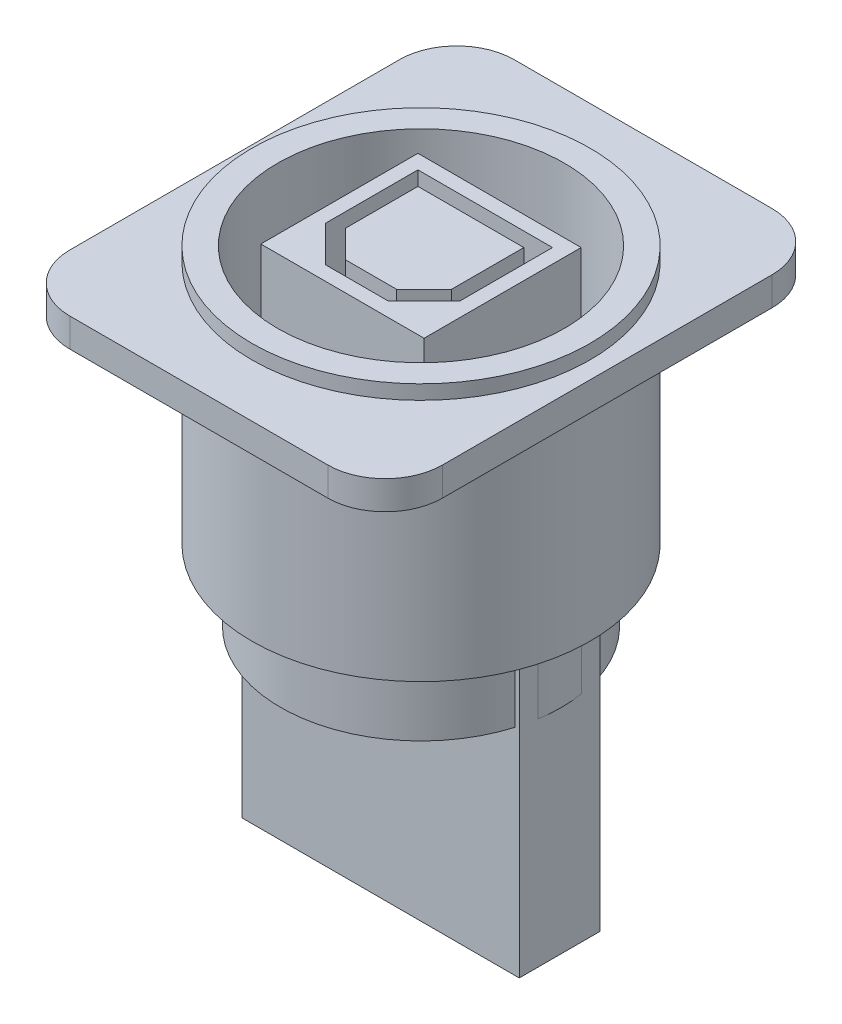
ISO-10303-21;
HEADER;
FILE_DESCRIPTION(('STEP AP214'),'2;1');
FILE_NAME('part.step','',(''),(''),'','','');
FILE_SCHEMA(('AUTOMOTIVE_DESIGN { 1 0 10303 214 1 1 1 1 }'));
ENDSEC;
DATA;
#1=APPLICATION_CONTEXT('core data for automotive mechanical design processes');
#2=APPLICATION_PROTOCOL_DEFINITION('international standard','automotive_design',2000,#1);
#3=PRODUCT_CONTEXT('',#1,'mechanical');
#4=PRODUCT('Part','Part','',(#3));
#5=PRODUCT_RELATED_PRODUCT_CATEGORY('part','',(#4));
#6=PRODUCT_DEFINITION_FORMATION('','',#4);
#7=PRODUCT_DEFINITION_CONTEXT('part definition',#1,'design');
#8=PRODUCT_DEFINITION('design','',#6,#7);
#9=PRODUCT_DEFINITION_SHAPE('','',#8);
#10=(LENGTH_UNIT() NAMED_UNIT(*) SI_UNIT(.MILLI.,.METRE.));
#11=(NAMED_UNIT(*) PLANE_ANGLE_UNIT() SI_UNIT($,.RADIAN.));
#12=(NAMED_UNIT(*) SI_UNIT($,.STERADIAN.) SOLID_ANGLE_UNIT());
#13=UNCERTAINTY_MEASURE_WITH_UNIT(LENGTH_MEASURE(1.E-05),#10,'distance_accuracy_value','');
#14=(GEOMETRIC_REPRESENTATION_CONTEXT(3) GLOBAL_UNCERTAINTY_ASSIGNED_CONTEXT((#13)) GLOBAL_UNIT_ASSIGNED_CONTEXT((#10,
#11,#12)) REPRESENTATION_CONTEXT('',''));
#15=CARTESIAN_POINT('',(0.,0.,0.));
#16=DIRECTION('',(0.,0.,1.));
#17=DIRECTION('',(1.,0.,0.));
#18=AXIS2_PLACEMENT_3D('',#15,#16,#17);
#19=CARTESIAN_POINT('',(9.68144968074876,-20.,-2.82375615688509));
#20=DIRECTION('',(-1.,0.,0.));
#21=DIRECTION('',(0.,0.,1.));
#22=AXIS2_PLACEMENT_3D('',#19,#20,#21);
#23=PLANE('',#22);
#24=DIRECTION('',(0.,1.,0.));
#25=VECTOR('',#24,1.);
#26=CARTESIAN_POINT('',(9.68144968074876,-5.,1.51971447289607));
#27=LINE('',#26,#25);
#28=CARTESIAN_POINT('',(9.68144968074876,0.,1.51971447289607));
#29=VERTEX_POINT('',#28);
#30=CARTESIAN_POINT('',(9.68144968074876,-5.,1.51971447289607));
#31=VERTEX_POINT('',#30);
#32=EDGE_CURVE('E357',#29,#31,#27,.F.);
#33=ORIENTED_EDGE('',*,*,#32,.F.);
#34=DIRECTION('',(0.,0.,1.));
#35=VECTOR('',#34,1.);
#36=CARTESIAN_POINT('',(9.68144968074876,0.,-2.82375615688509));
#37=LINE('',#36,#35);
#38=CARTESIAN_POINT('',(9.68144968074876,0.,2.82375615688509));
#39=VERTEX_POINT('',#38);
#40=EDGE_CURVE('E359',#29,#39,#37,.T.);
#41=ORIENTED_EDGE('',*,*,#40,.T.);
#42=DIRECTION('',(0.,1.,0.));
#43=VECTOR('',#42,1.);
#44=CARTESIAN_POINT('',(9.68144968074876,-20.,2.82375615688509));
#45=LINE('',#44,#43);
#46=CARTESIAN_POINT('',(9.68144968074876,-20.,2.82375615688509));
#47=VERTEX_POINT('',#46);
#48=EDGE_CURVE('E393',#47,#39,#45,.T.);
#49=ORIENTED_EDGE('',*,*,#48,.F.);
#50=DIRECTION('',(0.,0.,1.));
#51=VECTOR('',#50,1.);
#52=CARTESIAN_POINT('',(9.68144968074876,-20.,-2.82375615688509));
#53=LINE('',#52,#51);
#54=CARTESIAN_POINT('',(9.68144968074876,-20.,-2.82375615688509));
#55=VERTEX_POINT('',#54);
#56=EDGE_CURVE('E360',#55,#47,#53,.T.);
#57=ORIENTED_EDGE('',*,*,#56,.F.);
#58=DIRECTION('',(0.,1.,0.));
#59=VECTOR('',#58,1.);
#60=CARTESIAN_POINT('',(9.68144968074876,-20.,-2.82375615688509));
#61=LINE('',#60,#59);
#62=CARTESIAN_POINT('',(9.68144968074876,0.,-2.82375615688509));
#63=VERTEX_POINT('',#62);
#64=EDGE_CURVE('E370',#55,#63,#61,.T.);
#65=ORIENTED_EDGE('',*,*,#64,.T.);
#66=CARTESIAN_POINT('',(9.68144968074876,0.,-1.51971447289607));
#67=VERTEX_POINT('',#66);
#68=EDGE_CURVE('E371',#63,#67,#37,.T.);
#69=ORIENTED_EDGE('',*,*,#68,.T.);
#70=DIRECTION('',(0.,1.,0.));
#71=VECTOR('',#70,1.);
#72=CARTESIAN_POINT('',(9.68144968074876,-5.,-1.51971447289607));
#73=LINE('',#72,#71);
#74=CARTESIAN_POINT('',(9.68144968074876,-5.,-1.51971447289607));
#75=VERTEX_POINT('',#74);
#76=EDGE_CURVE('E355',#75,#67,#73,.T.);
#77=ORIENTED_EDGE('',*,*,#76,.F.);
#78=DIRECTION('',(0.,0.,1.));
#79=VECTOR('',#78,1.);
#80=CARTESIAN_POINT('',(9.68144968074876,-5.,-2.82375615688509));
#81=LINE('',#80,#79);
#82=EDGE_CURVE('E342',#75,#31,#81,.T.);
#83=ORIENTED_EDGE('',*,*,#82,.T.);
#84=EDGE_LOOP('',(#33,#41,#49,#57,#65,#69,#77,#83));
#85=FACE_BOUND('',#84,.T.);
#86=ADVANCED_FACE('F34',(#85),#23,.F.);
#87=CARTESIAN_POINT('',(-9.68144968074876,-20.,2.82375615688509));
#88=DIRECTION('',(0.,0.,-1.));
#89=DIRECTION('',(-1.,0.,0.));
#90=AXIS2_PLACEMENT_3D('',#87,#88,#89);
#91=PLANE('',#90);
#92=DIRECTION('',(0.,1.,0.));
#93=VECTOR('',#92,1.);
#94=CARTESIAN_POINT('',(-9.38437004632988,-5.,2.82375615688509));
#95=LINE('',#94,#93);
#96=CARTESIAN_POINT('',(-9.38437004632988,0.,2.82375615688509));
#97=VERTEX_POINT('',#96);
#98=CARTESIAN_POINT('',(-9.38437004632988,-5.,2.82375615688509));
#99=VERTEX_POINT('',#98);
#100=EDGE_CURVE('E352',#97,#99,#95,.F.);
#101=ORIENTED_EDGE('',*,*,#100,.F.);
#102=DIRECTION('',(-1.,0.,0.));
#103=VECTOR('',#102,1.);
#104=CARTESIAN_POINT('',(-9.68144968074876,0.,2.82375615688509));
#105=LINE('',#104,#103);
#106=CARTESIAN_POINT('',(-9.68144968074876,0.,2.82375615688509));
#107=VERTEX_POINT('',#106);
#108=EDGE_CURVE('E374',#97,#107,#105,.T.);
#109=ORIENTED_EDGE('',*,*,#108,.T.);
#110=DIRECTION('',(0.,1.,0.));
#111=VECTOR('',#110,1.);
#112=CARTESIAN_POINT('',(-9.68144968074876,-20.,2.82375615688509));
#113=LINE('',#112,#111);
#114=CARTESIAN_POINT('',(-9.68144968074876,-20.,2.82375615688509));
#115=VERTEX_POINT('',#114);
#116=EDGE_CURVE('E390',#115,#107,#113,.T.);
#117=ORIENTED_EDGE('',*,*,#116,.F.);
#118=DIRECTION('',(-1.,0.,0.));
#119=VECTOR('',#118,1.);
#120=CARTESIAN_POINT('',(-9.68144968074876,-20.,2.82375615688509));
#121=LINE('',#120,#119);
#122=EDGE_CURVE('E363',#47,#115,#121,.T.);
#123=ORIENTED_EDGE('',*,*,#122,.F.);
#124=ORIENTED_EDGE('',*,*,#48,.T.);
#125=CARTESIAN_POINT('',(9.38437004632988,0.,2.82375615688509));
#126=VERTEX_POINT('',#125);
#127=EDGE_CURVE('E375',#39,#126,#105,.T.);
#128=ORIENTED_EDGE('',*,*,#127,.T.);
#129=DIRECTION('',(0.,1.,0.));
#130=VECTOR('',#129,1.);
#131=CARTESIAN_POINT('',(9.38437004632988,-5.,2.82375615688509));
#132=LINE('',#131,#130);
#133=CARTESIAN_POINT('',(9.38437004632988,-5.,2.82375615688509));
#134=VERTEX_POINT('',#133);
#135=EDGE_CURVE('E350',#134,#126,#132,.T.);
#136=ORIENTED_EDGE('',*,*,#135,.F.);
#137=DIRECTION('',(-1.,0.,0.));
#138=VECTOR('',#137,1.);
#139=CARTESIAN_POINT('',(-9.68144968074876,-5.,2.82375615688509));
#140=LINE('',#139,#138);
#141=EDGE_CURVE('E339',#134,#99,#140,.T.);
#142=ORIENTED_EDGE('',*,*,#141,.T.);
#143=EDGE_LOOP('',(#101,#109,#117,#123,#124,#128,#136,#142));
#144=FACE_BOUND('',#143,.T.);
#145=ADVANCED_FACE('F638',(#144),#91,.F.);
#146=CARTESIAN_POINT('',(-9.68144968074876,-20.,-2.82375615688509));
#147=DIRECTION('',(1.,0.,0.));
#148=DIRECTION('',(0.,0.,-1.));
#149=AXIS2_PLACEMENT_3D('',#146,#147,#148);
#150=PLANE('',#149);
#151=DIRECTION('',(0.,1.,0.));
#152=VECTOR('',#151,1.);
#153=CARTESIAN_POINT('',(-9.68144968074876,-5.,-1.51971447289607));
#154=LINE('',#153,#152);
#155=CARTESIAN_POINT('',(-9.68144968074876,0.,-1.51971447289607));
#156=VERTEX_POINT('',#155);
#157=CARTESIAN_POINT('',(-9.68144968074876,-5.,-1.51971447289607));
#158=VERTEX_POINT('',#157);
#159=EDGE_CURVE('E347',#156,#158,#154,.F.);
#160=ORIENTED_EDGE('',*,*,#159,.F.);
#161=DIRECTION('',(0.,0.,-1.));
#162=VECTOR('',#161,1.);
#163=CARTESIAN_POINT('',(-9.68144968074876,0.,-2.82375615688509));
#164=LINE('',#163,#162);
#165=CARTESIAN_POINT('',(-9.68144968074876,0.,-2.82375615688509));
#166=VERTEX_POINT('',#165);
#167=EDGE_CURVE('E378',#156,#166,#164,.T.);
#168=ORIENTED_EDGE('',*,*,#167,.T.);
#169=DIRECTION('',(0.,1.,0.));
#170=VECTOR('',#169,1.);
#171=CARTESIAN_POINT('',(-9.68144968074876,-20.,-2.82375615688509));
#172=LINE('',#171,#170);
#173=CARTESIAN_POINT('',(-9.68144968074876,-20.,-2.82375615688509));
#174=VERTEX_POINT('',#173);
#175=EDGE_CURVE('E387',#174,#166,#172,.T.);
#176=ORIENTED_EDGE('',*,*,#175,.F.);
#177=DIRECTION('',(0.,0.,-1.));
#178=VECTOR('',#177,1.);
#179=CARTESIAN_POINT('',(-9.68144968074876,-20.,-2.82375615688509));
#180=LINE('',#179,#178);
#181=EDGE_CURVE('E366',#115,#174,#180,.T.);
#182=ORIENTED_EDGE('',*,*,#181,.F.);
#183=ORIENTED_EDGE('',*,*,#116,.T.);
#184=CARTESIAN_POINT('',(-9.68144968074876,0.,1.51971447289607));
#185=VERTEX_POINT('',#184);
#186=EDGE_CURVE('E379',#107,#185,#164,.T.);
#187=ORIENTED_EDGE('',*,*,#186,.T.);
#188=DIRECTION('',(0.,1.,0.));
#189=VECTOR('',#188,1.);
#190=CARTESIAN_POINT('',(-9.68144968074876,-5.,1.51971447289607));
#191=LINE('',#190,#189);
#192=CARTESIAN_POINT('',(-9.68144968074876,-5.,1.51971447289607));
#193=VERTEX_POINT('',#192);
#194=EDGE_CURVE('E345',#193,#185,#191,.T.);
#195=ORIENTED_EDGE('',*,*,#194,.F.);
#196=DIRECTION('',(0.,0.,-1.));
#197=VECTOR('',#196,1.);
#198=CARTESIAN_POINT('',(-9.68144968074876,-5.,-2.82375615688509));
#199=LINE('',#198,#197);
#200=EDGE_CURVE('E336',#193,#158,#199,.T.);
#201=ORIENTED_EDGE('',*,*,#200,.T.);
#202=EDGE_LOOP('',(#160,#168,#176,#182,#183,#187,#195,#201));
#203=FACE_BOUND('',#202,.T.);
#204=ADVANCED_FACE('F629',(#203),#150,.F.);
#205=CARTESIAN_POINT('',(-9.68144968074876,-20.,-2.82375615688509));
#206=DIRECTION('',(0.,0.,1.));
#207=DIRECTION('',(1.,0.,0.));
#208=AXIS2_PLACEMENT_3D('',#205,#206,#207);
#209=PLANE('',#208);
#210=DIRECTION('',(0.,1.,0.));
#211=VECTOR('',#210,1.);
#212=CARTESIAN_POINT('',(9.38437004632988,-5.,-2.82375615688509));
#213=LINE('',#212,#211);
#214=CARTESIAN_POINT('',(9.38437004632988,0.,-2.82375615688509));
#215=VERTEX_POINT('',#214);
#216=CARTESIAN_POINT('',(9.38437004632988,-5.,-2.82375615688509));
#217=VERTEX_POINT('',#216);
#218=EDGE_CURVE('E11',#215,#217,#213,.F.);
#219=ORIENTED_EDGE('',*,*,#218,.F.);
#220=DIRECTION('',(1.,0.,0.));
#221=VECTOR('',#220,1.);
#222=CARTESIAN_POINT('',(-9.68144968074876,0.,-2.82375615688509));
#223=LINE('',#222,#221);
#224=EDGE_CURVE('E382',#215,#63,#223,.T.);
#225=ORIENTED_EDGE('',*,*,#224,.T.);
#226=ORIENTED_EDGE('',*,*,#64,.F.);
#227=DIRECTION('',(1.,0.,0.));
#228=VECTOR('',#227,1.);
#229=CARTESIAN_POINT('',(-9.68144968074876,-20.,-2.82375615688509));
#230=LINE('',#229,#228);
#231=EDGE_CURVE('E368',#174,#55,#230,.T.);
#232=ORIENTED_EDGE('',*,*,#231,.F.);
#233=ORIENTED_EDGE('',*,*,#175,.T.);
#234=CARTESIAN_POINT('',(-9.38437004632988,0.,-2.82375615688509));
#235=VERTEX_POINT('',#234);
#236=EDGE_CURVE('E364',#166,#235,#223,.T.);
#237=ORIENTED_EDGE('',*,*,#236,.T.);
#238=DIRECTION('',(0.,1.,0.));
#239=VECTOR('',#238,1.);
#240=CARTESIAN_POINT('',(-9.38437004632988,-5.,-2.82375615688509));
#241=LINE('',#240,#239);
#242=CARTESIAN_POINT('',(-9.38437004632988,-5.,-2.82375615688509));
#243=VERTEX_POINT('',#242);
#244=EDGE_CURVE('E42',#243,#235,#241,.T.);
#245=ORIENTED_EDGE('',*,*,#244,.F.);
#246=DIRECTION('',(1.,0.,0.));
#247=VECTOR('',#246,1.);
#248=CARTESIAN_POINT('',(-9.68144968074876,-5.,-2.82375615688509));
#249=LINE('',#248,#247);
#250=EDGE_CURVE('E605',#243,#217,#249,.T.);
#251=ORIENTED_EDGE('',*,*,#250,.T.);
#252=EDGE_LOOP('',(#219,#225,#226,#232,#233,#237,#245,#251));
#253=FACE_BOUND('',#252,.T.);
#254=ADVANCED_FACE('F622',(#253),#209,.F.);
#255=CARTESIAN_POINT('',(0.,0.,0.));
#256=DIRECTION('',(0.,1.,0.));
#257=DIRECTION('',(0.,0.,1.));
#258=AXIS2_PLACEMENT_3D('',#255,#256,#257);
#259=PLANE('',#258);
#260=CARTESIAN_POINT('',(0.,0.,0.));
#261=DIRECTION('',(0.,-1.,0.));
#262=DIRECTION('',(0.,0.,-1.));
#263=AXIS2_PLACEMENT_3D('',#260,#261,#262);
#264=CIRCLE('',#263,9.8);
#265=EDGE_CURVE('E335',#185,#156,#264,.T.);
#266=ORIENTED_EDGE('',*,*,#265,.F.);
#267=ORIENTED_EDGE('',*,*,#186,.F.);
#268=ORIENTED_EDGE('',*,*,#108,.F.);
#269=EDGE_CURVE('E633',#126,#97,#264,.T.);
#270=ORIENTED_EDGE('',*,*,#269,.F.);
#271=ORIENTED_EDGE('',*,*,#127,.F.);
#272=ORIENTED_EDGE('',*,*,#40,.F.);
#273=EDGE_CURVE('E333',#67,#29,#264,.T.);
#274=ORIENTED_EDGE('',*,*,#273,.F.);
#275=ORIENTED_EDGE('',*,*,#68,.F.);
#276=ORIENTED_EDGE('',*,*,#224,.F.);
#277=EDGE_CURVE('E326',#235,#215,#264,.T.);
#278=ORIENTED_EDGE('',*,*,#277,.F.);
#279=ORIENTED_EDGE('',*,*,#236,.F.);
#280=ORIENTED_EDGE('',*,*,#167,.F.);
#281=EDGE_LOOP('',(#266,#267,#268,#270,#271,#272,#274,#275,#276,#278,#279,#280));
#282=FACE_BOUND('',#281,.T.);
#283=CARTESIAN_POINT('',(0.,0.,0.));
#284=DIRECTION('',(0.,1.,0.));
#285=DIRECTION('',(0.,0.,1.));
#286=AXIS2_PLACEMENT_3D('',#283,#284,#285);
#287=CIRCLE('',#286,11.8);
#288=CARTESIAN_POINT('',(0.,0.,11.8));
#289=VERTEX_POINT('',#288);
#290=EDGE_CURVE('E544',#289,#289,#287,.T.);
#291=ORIENTED_EDGE('',*,*,#290,.F.);
#292=EDGE_LOOP('',(#291));
#293=FACE_BOUND('',#292,.T.);
#294=ADVANCED_FACE('F618',(#282,#293),#259,.F.);
#295=CARTESIAN_POINT('',(0.,8.,0.));
#296=DIRECTION('',(0.,-1.,0.));
#297=DIRECTION('',(0.,0.,-1.));
#298=AXIS2_PLACEMENT_3D('',#295,#296,#297);
#299=PLANE('',#298);
#300=DIRECTION('',(1.,0.,0.));
#301=VECTOR('',#300,1.);
#302=CARTESIAN_POINT('',(-4.69497040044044,8.,4.48140901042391));
#303=LINE('',#302,#301);
#304=CARTESIAN_POINT('',(-2.19497040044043,8.,4.48140901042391));
#305=VERTEX_POINT('',#304);
#306=CARTESIAN_POINT('',(2.19497040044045,8.,4.48140901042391));
#307=VERTEX_POINT('',#306);
#308=EDGE_CURVE('E460',#305,#307,#303,.T.);
#309=ORIENTED_EDGE('',*,*,#308,.T.);
#310=DIRECTION('',(-0.707106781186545,0.,0.70710678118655));
#311=VECTOR('',#310,1.);
#312=CARTESIAN_POINT('',(4.69497040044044,8.,1.9814090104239));
#313=LINE('',#312,#311);
#314=CARTESIAN_POINT('',(4.69497040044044,8.,1.9814090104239));
#315=VERTEX_POINT('',#314);
#316=EDGE_CURVE('E597',#307,#315,#313,.F.);
#317=ORIENTED_EDGE('',*,*,#316,.T.);
#318=DIRECTION('',(0.,0.,-1.));
#319=VECTOR('',#318,1.);
#320=CARTESIAN_POINT('',(4.69497040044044,8.,4.48140901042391));
#321=LINE('',#320,#319);
#322=CARTESIAN_POINT('',(4.69497040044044,8.,-4.48140901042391));
#323=VERTEX_POINT('',#322);
#324=EDGE_CURVE('E451',#315,#323,#321,.T.);
#325=ORIENTED_EDGE('',*,*,#324,.T.);
#326=DIRECTION('',(-1.,0.,0.));
#327=VECTOR('',#326,1.);
#328=CARTESIAN_POINT('',(-4.69497040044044,8.,-4.48140901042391));
#329=LINE('',#328,#327);
#330=CARTESIAN_POINT('',(-4.69497040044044,8.,-4.48140901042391));
#331=VERTEX_POINT('',#330);
#332=EDGE_CURVE('E453',#323,#331,#329,.T.);
#333=ORIENTED_EDGE('',*,*,#332,.T.);
#334=DIRECTION('',(0.,0.,1.));
#335=VECTOR('',#334,1.);
#336=CARTESIAN_POINT('',(-4.69497040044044,8.,4.48140901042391));
#337=LINE('',#336,#335);
#338=CARTESIAN_POINT('',(-4.69497040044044,8.,1.98140901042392));
#339=VERTEX_POINT('',#338);
#340=EDGE_CURVE('E457',#331,#339,#337,.T.);
#341=ORIENTED_EDGE('',*,*,#340,.T.);
#342=DIRECTION('',(-0.70710678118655,0.,-0.707106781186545));
#343=VECTOR('',#342,1.);
#344=CARTESIAN_POINT('',(-2.19497040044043,8.,4.48140901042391));
#345=LINE('',#344,#343);
#346=EDGE_CURVE('E595',#339,#305,#345,.F.);
#347=ORIENTED_EDGE('',*,*,#346,.T.);
#348=EDGE_LOOP('',(#309,#317,#325,#333,#341,#347));
#349=FACE_BOUND('',#348,.T.);
#350=DIRECTION('',(0.707106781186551,0.,0.707106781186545));
#351=VECTOR('',#350,1.);
#352=CARTESIAN_POINT('',(-3.69497040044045,8.,1.56719544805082));
#353=LINE('',#352,#351);
#354=CARTESIAN_POINT('',(-3.69497040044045,8.,1.56719544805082));
#355=VERTEX_POINT('',#354);
#356=CARTESIAN_POINT('',(-1.78075683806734,8.,3.48140901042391));
#357=VERTEX_POINT('',#356);
#358=EDGE_CURVE('E418',#355,#357,#353,.T.);
#359=ORIENTED_EDGE('',*,*,#358,.F.);
#360=DIRECTION('',(0.,0.,1.));
#361=VECTOR('',#360,1.);
#362=CARTESIAN_POINT('',(-3.69497040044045,8.,-3.48140901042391));
#363=LINE('',#362,#361);
#364=CARTESIAN_POINT('',(-3.69497040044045,8.,-3.48140901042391));
#365=VERTEX_POINT('',#364);
#366=EDGE_CURVE('E397',#365,#355,#363,.T.);
#367=ORIENTED_EDGE('',*,*,#366,.F.);
#368=DIRECTION('',(-1.,0.,0.));
#369=VECTOR('',#368,1.);
#370=CARTESIAN_POINT('',(3.69497040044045,8.,-3.48140901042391));
#371=LINE('',#370,#369);
#372=CARTESIAN_POINT('',(3.69497040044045,8.,-3.48140901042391));
#373=VERTEX_POINT('',#372);
#374=EDGE_CURVE('E402',#373,#365,#371,.T.);
#375=ORIENTED_EDGE('',*,*,#374,.F.);
#376=DIRECTION('',(0.,0.,-1.));
#377=VECTOR('',#376,1.);
#378=CARTESIAN_POINT('',(3.69497040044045,8.,1.5671954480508));
#379=LINE('',#378,#377);
#380=CARTESIAN_POINT('',(3.69497040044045,8.,1.5671954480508));
#381=VERTEX_POINT('',#380);
#382=EDGE_CURVE('E406',#381,#373,#379,.T.);
#383=ORIENTED_EDGE('',*,*,#382,.F.);
#384=DIRECTION('',(0.707106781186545,0.,-0.707106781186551));
#385=VECTOR('',#384,1.);
#386=CARTESIAN_POINT('',(1.78075683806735,8.,3.48140901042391));
#387=LINE('',#386,#385);
#388=CARTESIAN_POINT('',(1.78075683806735,8.,3.48140901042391));
#389=VERTEX_POINT('',#388);
#390=EDGE_CURVE('E410',#389,#381,#387,.T.);
#391=ORIENTED_EDGE('',*,*,#390,.F.);
#392=DIRECTION('',(1.,0.,0.));
#393=VECTOR('',#392,1.);
#394=CARTESIAN_POINT('',(-1.78075683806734,8.,3.48140901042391));
#395=LINE('',#394,#393);
#396=EDGE_CURVE('E414',#357,#389,#395,.T.);
#397=ORIENTED_EDGE('',*,*,#396,.F.);
#398=EDGE_LOOP('',(#359,#367,#375,#383,#391,#397));
#399=FACE_BOUND('',#398,.T.);
#400=ADVANCED_FACE('F708',(#349,#399),#299,.F.);
#401=CARTESIAN_POINT('',(0.,8.,0.));
#402=DIRECTION('',(0.,1.,0.));
#403=DIRECTION('',(0.,0.,1.));
#404=AXIS2_PLACEMENT_3D('',#401,#402,#403);
#405=PLANE('',#404);
#406=CARTESIAN_POINT('',(0.,8.,0.));
#407=DIRECTION('',(0.,1.,0.));
#408=DIRECTION('',(0.,0.,1.));
#409=AXIS2_PLACEMENT_3D('',#406,#407,#408);
#410=CIRCLE('',#409,10.);
#411=CARTESIAN_POINT('',(0.,8.,10.));
#412=VERTEX_POINT('',#411);
#413=EDGE_CURVE('E510',#412,#412,#410,.T.);
#414=ORIENTED_EDGE('',*,*,#413,.T.);
#415=EDGE_LOOP('',(#414));
#416=FACE_BOUND('',#415,.T.);
#417=DIRECTION('',(-1.,0.,0.));
#418=VECTOR('',#417,1.);
#419=CARTESIAN_POINT('',(-5.69497040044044,8.,-5.48140901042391));
#420=LINE('',#419,#418);
#421=CARTESIAN_POINT('',(5.69497040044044,8.,-5.48140901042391));
#422=VERTEX_POINT('',#421);
#423=CARTESIAN_POINT('',(-5.69497040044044,8.,-5.48140901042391));
#424=VERTEX_POINT('',#423);
#425=EDGE_CURVE('E486',#422,#424,#420,.T.);
#426=ORIENTED_EDGE('',*,*,#425,.F.);
#427=DIRECTION('',(0.,0.,-1.));
#428=VECTOR('',#427,1.);
#429=CARTESIAN_POINT('',(5.69497040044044,8.,5.48140901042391));
#430=LINE('',#429,#428);
#431=CARTESIAN_POINT('',(5.69497040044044,8.,5.48140901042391));
#432=VERTEX_POINT('',#431);
#433=EDGE_CURVE('E490',#432,#422,#430,.T.);
#434=ORIENTED_EDGE('',*,*,#433,.F.);
#435=DIRECTION('',(1.,0.,0.));
#436=VECTOR('',#435,1.);
#437=CARTESIAN_POINT('',(-5.69497040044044,8.,5.48140901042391));
#438=LINE('',#437,#436);
#439=CARTESIAN_POINT('',(-5.69497040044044,8.,5.48140901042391));
#440=VERTEX_POINT('',#439);
#441=EDGE_CURVE('E478',#440,#432,#438,.T.);
#442=ORIENTED_EDGE('',*,*,#441,.F.);
#443=DIRECTION('',(0.,0.,1.));
#444=VECTOR('',#443,1.);
#445=CARTESIAN_POINT('',(-5.69497040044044,8.,5.48140901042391));
#446=LINE('',#445,#444);
#447=EDGE_CURVE('E483',#424,#440,#446,.T.);
#448=ORIENTED_EDGE('',*,*,#447,.F.);
#449=EDGE_LOOP('',(#426,#434,#442,#448));
#450=FACE_BOUND('',#449,.T.);
#451=ADVANCED_FACE('F711',(#416,#450),#405,.T.);
#452=CARTESIAN_POINT('',(0.,18.,0.));
#453=DIRECTION('',(0.,-1.,0.));
#454=DIRECTION('',(0.,0.,-1.));
#455=AXIS2_PLACEMENT_3D('',#452,#453,#454);
#456=CYLINDRICAL_SURFACE('',#455,11.8);
#457=CARTESIAN_POINT('',(0.,17.,0.));
#458=DIRECTION('',(0.,1.,0.));
#459=DIRECTION('',(0.,0.,1.));
#460=AXIS2_PLACEMENT_3D('',#457,#458,#459);
#461=CIRCLE('',#460,11.8);
#462=CARTESIAN_POINT('',(0.,17.,11.8));
#463=VERTEX_POINT('',#462);
#464=EDGE_CURVE('E529',#463,#463,#461,.T.);
#465=ORIENTED_EDGE('',*,*,#464,.T.);
#466=EDGE_LOOP('',(#465));
#467=FACE_BOUND('',#466,.T.);
#468=CARTESIAN_POINT('',(0.,18.,0.));
#469=DIRECTION('',(0.,1.,0.));
#470=DIRECTION('',(0.,0.,1.));
#471=AXIS2_PLACEMENT_3D('',#468,#469,#470);
#472=CIRCLE('',#471,11.8);
#473=CARTESIAN_POINT('',(0.,18.,11.8));
#474=VERTEX_POINT('',#473);
#475=EDGE_CURVE('E540',#474,#474,#472,.T.);
#476=ORIENTED_EDGE('',*,*,#475,.F.);
#477=EDGE_LOOP('',(#476));
#478=FACE_BOUND('',#477,.T.);
#479=ADVANCED_FACE('F753',(#467,#478),#456,.T.);
#480=CARTESIAN_POINT('',(0.,18.,0.));
#481=DIRECTION('',(0.,1.,0.));
#482=DIRECTION('',(0.,0.,1.));
#483=AXIS2_PLACEMENT_3D('',#480,#481,#482);
#484=PLANE('',#483);
#485=CARTESIAN_POINT('',(0.,18.,0.));
#486=DIRECTION('',(0.,1.,0.));
#487=DIRECTION('',(0.,0.,1.));
#488=AXIS2_PLACEMENT_3D('',#485,#486,#487);
#489=CIRCLE('',#488,10.);
#490=CARTESIAN_POINT('',(0.,18.,10.));
#491=VERTEX_POINT('',#490);
#492=EDGE_CURVE('E496',#491,#491,#489,.T.);
#493=ORIENTED_EDGE('',*,*,#492,.F.);
#494=EDGE_LOOP('',(#493));
#495=FACE_BOUND('',#494,.T.);
#496=ORIENTED_EDGE('',*,*,#475,.T.);
#497=EDGE_LOOP('',(#496));
#498=FACE_BOUND('',#497,.T.);
#499=ADVANCED_FACE('F783',(#495,#498),#484,.T.);
#500=CARTESIAN_POINT('',(-13.,17.,-15.5));
#501=DIRECTION('',(0.,0.,-1.));
#502=DIRECTION('',(-1.,0.,0.));
#503=AXIS2_PLACEMENT_3D('',#500,#501,#502);
#504=PLANE('',#503);
#505=DIRECTION('',(1.,0.,0.));
#506=VECTOR('',#505,1.);
#507=CARTESIAN_POINT('',(-13.,17.,-15.5));
#508=LINE('',#507,#506);
#509=CARTESIAN_POINT('',(-9.00000000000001,17.,-15.5));
#510=VERTEX_POINT('',#509);
#511=CARTESIAN_POINT('',(8.99999999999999,17.,-15.5));
#512=VERTEX_POINT('',#511);
#513=EDGE_CURVE('E516',#510,#512,#508,.T.);
#514=ORIENTED_EDGE('',*,*,#513,.T.);
#515=DIRECTION('',(0.,-1.,0.));
#516=VECTOR('',#515,1.);
#517=CARTESIAN_POINT('',(9.,15.,-15.5));
#518=LINE('',#517,#516);
#519=CARTESIAN_POINT('',(8.99999999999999,15.,-15.5));
#520=VERTEX_POINT('',#519);
#521=EDGE_CURVE('E579',#512,#520,#518,.T.);
#522=ORIENTED_EDGE('',*,*,#521,.T.);
#523=DIRECTION('',(1.,0.,0.));
#524=VECTOR('',#523,1.);
#525=CARTESIAN_POINT('',(-13.,15.,-15.5));
#526=LINE('',#525,#524);
#527=CARTESIAN_POINT('',(-9.00000000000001,15.,-15.5));
#528=VERTEX_POINT('',#527);
#529=EDGE_CURVE('E513',#528,#520,#526,.T.);
#530=ORIENTED_EDGE('',*,*,#529,.F.);
#531=DIRECTION('',(0.,-1.,0.));
#532=VECTOR('',#531,1.);
#533=CARTESIAN_POINT('',(-9.,17.,-15.5));
#534=LINE('',#533,#532);
#535=EDGE_CURVE('E577',#528,#510,#534,.F.);
#536=ORIENTED_EDGE('',*,*,#535,.T.);
#537=EDGE_LOOP('',(#514,#522,#530,#536));
#538=FACE_BOUND('',#537,.T.);
#539=ADVANCED_FACE('F773',(#538),#504,.T.);
#540=CARTESIAN_POINT('',(-13.,17.,15.5));
#541=DIRECTION('',(-1.,0.,0.));
#542=DIRECTION('',(0.,0.,1.));
#543=AXIS2_PLACEMENT_3D('',#540,#541,#542);
#544=PLANE('',#543);
#545=DIRECTION('',(0.,0.,-1.));
#546=VECTOR('',#545,1.);
#547=CARTESIAN_POINT('',(-13.,17.,15.5));
#548=LINE('',#547,#546);
#549=CARTESIAN_POINT('',(-13.,17.,11.5));
#550=VERTEX_POINT('',#549);
#551=CARTESIAN_POINT('',(-13.,17.,-11.5));
#552=VERTEX_POINT('',#551);
#553=EDGE_CURVE('E526',#550,#552,#548,.T.);
#554=ORIENTED_EDGE('',*,*,#553,.T.);
#555=DIRECTION('',(0.,-1.,0.));
#556=VECTOR('',#555,1.);
#557=CARTESIAN_POINT('',(-13.,17.,-11.5));
#558=LINE('',#557,#556);
#559=CARTESIAN_POINT('',(-13.,15.,-11.5));
#560=VERTEX_POINT('',#559);
#561=EDGE_CURVE('E584',#552,#560,#558,.T.);
#562=ORIENTED_EDGE('',*,*,#561,.T.);
#563=DIRECTION('',(0.,0.,-1.));
#564=VECTOR('',#563,1.);
#565=CARTESIAN_POINT('',(-13.,15.,15.5));
#566=LINE('',#565,#564);
#567=CARTESIAN_POINT('',(-13.,15.,11.5));
#568=VERTEX_POINT('',#567);
#569=EDGE_CURVE('E520',#568,#560,#566,.T.);
#570=ORIENTED_EDGE('',*,*,#569,.F.);
#571=DIRECTION('',(0.,-1.,0.));
#572=VECTOR('',#571,1.);
#573=CARTESIAN_POINT('',(-13.,17.,11.5));
#574=LINE('',#573,#572);
#575=EDGE_CURVE('E582',#568,#550,#574,.F.);
#576=ORIENTED_EDGE('',*,*,#575,.T.);
#577=EDGE_LOOP('',(#554,#562,#570,#576));
#578=FACE_BOUND('',#577,.T.);
#579=ADVANCED_FACE('F769',(#578),#544,.T.);
#580=CARTESIAN_POINT('',(-13.,17.,15.5));
#581=DIRECTION('',(0.,0.,-1.));
#582=DIRECTION('',(-1.,0.,0.));
#583=AXIS2_PLACEMENT_3D('',#580,#581,#582);
#584=PLANE('',#583);
#585=DIRECTION('',(1.,0.,0.));
#586=VECTOR('',#585,1.);
#587=CARTESIAN_POINT('',(-13.,15.,15.5));
#588=LINE('',#587,#586);
#589=CARTESIAN_POINT('',(-9.00000000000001,15.,15.5));
#590=VERTEX_POINT('',#589);
#591=CARTESIAN_POINT('',(8.99999999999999,15.,15.5));
#592=VERTEX_POINT('',#591);
#593=EDGE_CURVE('E535',#590,#592,#588,.T.);
#594=ORIENTED_EDGE('',*,*,#593,.T.);
#595=DIRECTION('',(0.,-1.,0.));
#596=VECTOR('',#595,1.);
#597=CARTESIAN_POINT('',(9.,17.,15.5));
#598=LINE('',#597,#596);
#599=CARTESIAN_POINT('',(8.99999999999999,17.,15.5));
#600=VERTEX_POINT('',#599);
#601=EDGE_CURVE('E567',#592,#600,#598,.F.);
#602=ORIENTED_EDGE('',*,*,#601,.T.);
#603=DIRECTION('',(1.,0.,0.));
#604=VECTOR('',#603,1.);
#605=CARTESIAN_POINT('',(-13.,17.,15.5));
#606=LINE('',#605,#604);
#607=CARTESIAN_POINT('',(-9.00000000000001,17.,15.5));
#608=VERTEX_POINT('',#607);
#609=EDGE_CURVE('E523',#608,#600,#606,.T.);
#610=ORIENTED_EDGE('',*,*,#609,.F.);
#611=DIRECTION('',(0.,-1.,0.));
#612=VECTOR('',#611,1.);
#613=CARTESIAN_POINT('',(-9.,15.,15.5));
#614=LINE('',#613,#612);
#615=EDGE_CURVE('E564',#608,#590,#614,.T.);
#616=ORIENTED_EDGE('',*,*,#615,.T.);
#617=EDGE_LOOP('',(#594,#602,#610,#616));
#618=FACE_BOUND('',#617,.T.);
#619=ADVANCED_FACE('F772',(#618),#584,.F.);
#620=CARTESIAN_POINT('',(13.,17.,15.5));
#621=DIRECTION('',(-1.,0.,0.));
#622=DIRECTION('',(0.,0.,1.));
#623=AXIS2_PLACEMENT_3D('',#620,#621,#622);
#624=PLANE('',#623);
#625=DIRECTION('',(0.,0.,-1.));
#626=VECTOR('',#625,1.);
#627=CARTESIAN_POINT('',(13.,17.,15.5));
#628=LINE('',#627,#626);
#629=CARTESIAN_POINT('',(13.,17.,11.5));
#630=VERTEX_POINT('',#629);
#631=CARTESIAN_POINT('',(13.,17.,-11.5));
#632=VERTEX_POINT('',#631);
#633=EDGE_CURVE('E519',#630,#632,#628,.T.);
#634=ORIENTED_EDGE('',*,*,#633,.F.);
#635=DIRECTION('',(0.,-1.,0.));
#636=VECTOR('',#635,1.);
#637=CARTESIAN_POINT('',(13.,17.,11.5));
#638=LINE('',#637,#636);
#639=CARTESIAN_POINT('',(13.,15.,11.5));
#640=VERTEX_POINT('',#639);
#641=EDGE_CURVE('E553',#630,#640,#638,.T.);
#642=ORIENTED_EDGE('',*,*,#641,.T.);
#643=DIRECTION('',(0.,0.,-1.));
#644=VECTOR('',#643,1.);
#645=CARTESIAN_POINT('',(13.,15.,15.5));
#646=LINE('',#645,#644);
#647=CARTESIAN_POINT('',(13.,15.,-11.5));
#648=VERTEX_POINT('',#647);
#649=EDGE_CURVE('E532',#640,#648,#646,.T.);
#650=ORIENTED_EDGE('',*,*,#649,.T.);
#651=DIRECTION('',(0.,-1.,0.));
#652=VECTOR('',#651,1.);
#653=CARTESIAN_POINT('',(13.,17.,-11.5));
#654=LINE('',#653,#652);
#655=EDGE_CURVE('E549',#648,#632,#654,.F.);
#656=ORIENTED_EDGE('',*,*,#655,.T.);
#657=EDGE_LOOP('',(#634,#642,#650,#656));
#658=FACE_BOUND('',#657,.T.);
#659=ADVANCED_FACE('F763',(#658),#624,.F.);
#660=CARTESIAN_POINT('',(0.,17.,0.));
#661=DIRECTION('',(0.,1.,0.));
#662=DIRECTION('',(0.,0.,1.));
#663=AXIS2_PLACEMENT_3D('',#660,#661,#662);
#664=PLANE('',#663);
#665=ORIENTED_EDGE('',*,*,#464,.F.);
#666=EDGE_LOOP('',(#665));
#667=FACE_BOUND('',#666,.T.);
#668=ORIENTED_EDGE('',*,*,#609,.T.);
#669=CARTESIAN_POINT('',(9.,17.,11.5));
#670=DIRECTION('',(0.,1.,0.));
#671=DIRECTION('',(0.,0.,1.));
#672=AXIS2_PLACEMENT_3D('',#669,#670,#671);
#673=CIRCLE('',#672,4.);
#674=EDGE_CURVE('E575',#600,#630,#673,.T.);
#675=ORIENTED_EDGE('',*,*,#674,.T.);
#676=ORIENTED_EDGE('',*,*,#633,.T.);
#677=CARTESIAN_POINT('',(9.,17.,-11.5));
#678=DIRECTION('',(0.,1.,0.));
#679=DIRECTION('',(0.,0.,1.));
#680=AXIS2_PLACEMENT_3D('',#677,#678,#679);
#681=CIRCLE('',#680,4.);
#682=EDGE_CURVE('E573',#632,#512,#681,.T.);
#683=ORIENTED_EDGE('',*,*,#682,.T.);
#684=ORIENTED_EDGE('',*,*,#513,.F.);
#685=CARTESIAN_POINT('',(-9.,17.,-11.5));
#686=DIRECTION('',(0.,1.,0.));
#687=DIRECTION('',(0.,0.,1.));
#688=AXIS2_PLACEMENT_3D('',#685,#686,#687);
#689=CIRCLE('',#688,4.);
#690=EDGE_CURVE('E571',#510,#552,#689,.T.);
#691=ORIENTED_EDGE('',*,*,#690,.T.);
#692=ORIENTED_EDGE('',*,*,#553,.F.);
#693=CARTESIAN_POINT('',(-9.,17.,11.5));
#694=DIRECTION('',(0.,1.,0.));
#695=DIRECTION('',(0.,0.,1.));
#696=AXIS2_PLACEMENT_3D('',#693,#694,#695);
#697=CIRCLE('',#696,4.);
#698=EDGE_CURVE('E569',#550,#608,#697,.T.);
#699=ORIENTED_EDGE('',*,*,#698,.T.);
#700=EDGE_LOOP('',(#668,#675,#676,#683,#684,#691,#692,#699));
#701=FACE_BOUND('',#700,.T.);
#702=ADVANCED_FACE('F759',(#667,#701),#664,.T.);
#703=CARTESIAN_POINT('',(0.,15.,0.));
#704=DIRECTION('',(0.,1.,0.));
#705=DIRECTION('',(0.,0.,1.));
#706=AXIS2_PLACEMENT_3D('',#703,#704,#705);
#707=PLANE('',#706);
#708=CARTESIAN_POINT('',(0.,15.,0.));
#709=DIRECTION('',(0.,1.,0.));
#710=DIRECTION('',(0.,0.,1.));
#711=AXIS2_PLACEMENT_3D('',#708,#709,#710);
#712=CIRCLE('',#711,11.8);
#713=CARTESIAN_POINT('',(0.,15.,11.8));
#714=VERTEX_POINT('',#713);
#715=EDGE_CURVE('E543',#714,#714,#712,.T.);
#716=ORIENTED_EDGE('',*,*,#715,.T.);
#717=EDGE_LOOP('',(#716));
#718=FACE_BOUND('',#717,.T.);
#719=ORIENTED_EDGE('',*,*,#649,.F.);
#720=CARTESIAN_POINT('',(9.,15.,11.5));
#721=DIRECTION('',(0.,1.,0.));
#722=DIRECTION('',(0.,0.,1.));
#723=AXIS2_PLACEMENT_3D('',#720,#721,#722);
#724=CIRCLE('',#723,4.);
#725=EDGE_CURVE('E562',#640,#592,#724,.F.);
#726=ORIENTED_EDGE('',*,*,#725,.T.);
#727=ORIENTED_EDGE('',*,*,#593,.F.);
#728=CARTESIAN_POINT('',(-9.,15.,11.5));
#729=DIRECTION('',(0.,1.,0.));
#730=DIRECTION('',(0.,0.,1.));
#731=AXIS2_PLACEMENT_3D('',#728,#729,#730);
#732=CIRCLE('',#731,4.);
#733=EDGE_CURVE('E556',#590,#568,#732,.F.);
#734=ORIENTED_EDGE('',*,*,#733,.T.);
#735=ORIENTED_EDGE('',*,*,#569,.T.);
#736=CARTESIAN_POINT('',(-9.,15.,-11.5));
#737=DIRECTION('',(0.,1.,0.));
#738=DIRECTION('',(0.,0.,1.));
#739=AXIS2_PLACEMENT_3D('',#736,#737,#738);
#740=CIRCLE('',#739,4.);
#741=EDGE_CURVE('E558',#560,#528,#740,.F.);
#742=ORIENTED_EDGE('',*,*,#741,.T.);
#743=ORIENTED_EDGE('',*,*,#529,.T.);
#744=CARTESIAN_POINT('',(9.,15.,-11.5));
#745=DIRECTION('',(0.,1.,0.));
#746=DIRECTION('',(0.,0.,1.));
#747=AXIS2_PLACEMENT_3D('',#744,#745,#746);
#748=CIRCLE('',#747,4.);
#749=EDGE_CURVE('E560',#520,#648,#748,.F.);
#750=ORIENTED_EDGE('',*,*,#749,.T.);
#751=EDGE_LOOP('',(#719,#726,#727,#734,#735,#742,#743,#750));
#752=FACE_BOUND('',#751,.T.);
#753=ADVANCED_FACE('F762',(#718,#752),#707,.F.);
#754=ORIENTED_EDGE('',*,*,#290,.T.);
#755=EDGE_LOOP('',(#754));
#756=FACE_BOUND('',#755,.T.);
#757=ORIENTED_EDGE('',*,*,#715,.F.);
#758=EDGE_LOOP('',(#757));
#759=FACE_BOUND('',#758,.T.);
#760=ADVANCED_FACE('F767',(#756,#759),#456,.T.);
#761=CARTESIAN_POINT('',(9.,17.,11.5));
#762=DIRECTION('',(0.,-1.,0.));
#763=DIRECTION('',(0.,0.,-1.));
#764=AXIS2_PLACEMENT_3D('',#761,#762,#763);
#765=CYLINDRICAL_SURFACE('',#764,4.);
#766=ORIENTED_EDGE('',*,*,#674,.F.);
#767=ORIENTED_EDGE('',*,*,#601,.F.);
#768=ORIENTED_EDGE('',*,*,#725,.F.);
#769=ORIENTED_EDGE('',*,*,#641,.F.);
#770=EDGE_LOOP('',(#766,#767,#768,#769));
#771=FACE_BOUND('',#770,.T.);
#772=ADVANCED_FACE('F793',(#771),#765,.T.);
#773=CARTESIAN_POINT('',(9.,17.,-11.5));
#774=DIRECTION('',(0.,1.,0.));
#775=DIRECTION('',(0.,0.,1.));
#776=AXIS2_PLACEMENT_3D('',#773,#774,#775);
#777=CYLINDRICAL_SURFACE('',#776,4.);
#778=ORIENTED_EDGE('',*,*,#682,.F.);
#779=ORIENTED_EDGE('',*,*,#655,.F.);
#780=ORIENTED_EDGE('',*,*,#749,.F.);
#781=ORIENTED_EDGE('',*,*,#521,.F.);
#782=EDGE_LOOP('',(#778,#779,#780,#781));
#783=FACE_BOUND('',#782,.T.);
#784=ADVANCED_FACE('F796',(#783),#777,.T.);
#785=CARTESIAN_POINT('',(-9.,17.,-11.5));
#786=DIRECTION('',(0.,-1.,0.));
#787=DIRECTION('',(0.,0.,-1.));
#788=AXIS2_PLACEMENT_3D('',#785,#786,#787);
#789=CYLINDRICAL_SURFACE('',#788,4.);
#790=ORIENTED_EDGE('',*,*,#690,.F.);
#791=ORIENTED_EDGE('',*,*,#535,.F.);
#792=ORIENTED_EDGE('',*,*,#741,.F.);
#793=ORIENTED_EDGE('',*,*,#561,.F.);
#794=EDGE_LOOP('',(#790,#791,#792,#793));
#795=FACE_BOUND('',#794,.T.);
#796=ADVANCED_FACE('F800',(#795),#789,.T.);
#797=CARTESIAN_POINT('',(-9.,17.,11.5));
#798=DIRECTION('',(0.,1.,0.));
#799=DIRECTION('',(0.,0.,1.));
#800=AXIS2_PLACEMENT_3D('',#797,#798,#799);
#801=CYLINDRICAL_SURFACE('',#800,4.);
#802=ORIENTED_EDGE('',*,*,#698,.F.);
#803=ORIENTED_EDGE('',*,*,#575,.F.);
#804=ORIENTED_EDGE('',*,*,#733,.F.);
#805=ORIENTED_EDGE('',*,*,#615,.F.);
#806=EDGE_LOOP('',(#802,#803,#804,#805));
#807=FACE_BOUND('',#806,.T.);
#808=ADVANCED_FACE('F757',(#807),#801,.T.);
#809=CARTESIAN_POINT('',(0.,8.,0.));
#810=DIRECTION('',(0.,1.,0.));
#811=DIRECTION('',(0.,0.,1.));
#812=AXIS2_PLACEMENT_3D('',#809,#810,#811);
#813=CYLINDRICAL_SURFACE('',#812,10.);
#814=ORIENTED_EDGE('',*,*,#413,.F.);
#815=EDGE_LOOP('',(#814));
#816=FACE_BOUND('',#815,.T.);
#817=ORIENTED_EDGE('',*,*,#492,.T.);
#818=EDGE_LOOP('',(#817));
#819=FACE_BOUND('',#818,.T.);
#820=ADVANCED_FACE('F746',(#816,#819),#813,.F.);
#821=CARTESIAN_POINT('',(5.69497040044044,33.8086726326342,5.48140901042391));
#822=DIRECTION('',(-1.,0.,0.));
#823=DIRECTION('',(0.,0.,1.));
#824=AXIS2_PLACEMENT_3D('',#821,#822,#823);
#825=PLANE('',#824);
#826=DIRECTION('',(0.,0.,-1.));
#827=VECTOR('',#826,1.);
#828=CARTESIAN_POINT('',(5.69497040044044,18.,5.48140901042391));
#829=LINE('',#828,#827);
#830=CARTESIAN_POINT('',(5.69497040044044,18.,5.48140901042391));
#831=VERTEX_POINT('',#830);
#832=CARTESIAN_POINT('',(5.69497040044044,18.,-5.48140901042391));
#833=VERTEX_POINT('',#832);
#834=EDGE_CURVE('E500',#831,#833,#829,.T.);
#835=ORIENTED_EDGE('',*,*,#834,.F.);
#836=DIRECTION('',(0.,-1.,0.));
#837=VECTOR('',#836,1.);
#838=CARTESIAN_POINT('',(5.69497040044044,33.8086726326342,5.48140901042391));
#839=LINE('',#838,#837);
#840=EDGE_CURVE('E475',#831,#432,#839,.T.);
#841=ORIENTED_EDGE('',*,*,#840,.T.);
#842=ORIENTED_EDGE('',*,*,#433,.T.);
#843=DIRECTION('',(0.,-1.,0.));
#844=VECTOR('',#843,1.);
#845=CARTESIAN_POINT('',(5.69497040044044,33.8086726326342,-5.48140901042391));
#846=LINE('',#845,#844);
#847=EDGE_CURVE('E489',#833,#422,#846,.T.);
#848=ORIENTED_EDGE('',*,*,#847,.F.);
#849=EDGE_LOOP('',(#835,#841,#842,#848));
#850=FACE_BOUND('',#849,.T.);
#851=ADVANCED_FACE('F742',(#850),#825,.F.);
#852=CARTESIAN_POINT('',(-5.69497040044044,33.8086726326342,-5.48140901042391));
#853=DIRECTION('',(0.,0.,1.));
#854=DIRECTION('',(1.,0.,0.));
#855=AXIS2_PLACEMENT_3D('',#852,#853,#854);
#856=PLANE('',#855);
#857=DIRECTION('',(-1.,0.,0.));
#858=VECTOR('',#857,1.);
#859=CARTESIAN_POINT('',(-5.69497040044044,18.,-5.48140901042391));
#860=LINE('',#859,#858);
#861=CARTESIAN_POINT('',(-5.69497040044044,18.,-5.48140901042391));
#862=VERTEX_POINT('',#861);
#863=EDGE_CURVE('E497',#833,#862,#860,.T.);
#864=ORIENTED_EDGE('',*,*,#863,.F.);
#865=ORIENTED_EDGE('',*,*,#847,.T.);
#866=ORIENTED_EDGE('',*,*,#425,.T.);
#867=DIRECTION('',(0.,-1.,0.));
#868=VECTOR('',#867,1.);
#869=CARTESIAN_POINT('',(-5.69497040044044,33.8086726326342,-5.48140901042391));
#870=LINE('',#869,#868);
#871=EDGE_CURVE('E485',#862,#424,#870,.T.);
#872=ORIENTED_EDGE('',*,*,#871,.F.);
#873=EDGE_LOOP('',(#864,#865,#866,#872));
#874=FACE_BOUND('',#873,.T.);
#875=ADVANCED_FACE('F738',(#874),#856,.F.);
#876=CARTESIAN_POINT('',(-5.69497040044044,33.8086726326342,5.48140901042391));
#877=DIRECTION('',(1.,0.,0.));
#878=DIRECTION('',(0.,0.,-1.));
#879=AXIS2_PLACEMENT_3D('',#876,#877,#878);
#880=PLANE('',#879);
#881=DIRECTION('',(0.,0.,1.));
#882=VECTOR('',#881,1.);
#883=CARTESIAN_POINT('',(-5.69497040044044,18.,5.48140901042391));
#884=LINE('',#883,#882);
#885=CARTESIAN_POINT('',(-5.69497040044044,18.,5.48140901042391));
#886=VERTEX_POINT('',#885);
#887=EDGE_CURVE('E493',#862,#886,#884,.T.);
#888=ORIENTED_EDGE('',*,*,#887,.F.);
#889=ORIENTED_EDGE('',*,*,#871,.T.);
#890=ORIENTED_EDGE('',*,*,#447,.T.);
#891=DIRECTION('',(0.,-1.,0.));
#892=VECTOR('',#891,1.);
#893=CARTESIAN_POINT('',(-5.69497040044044,33.8086726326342,5.48140901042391));
#894=LINE('',#893,#892);
#895=EDGE_CURVE('E482',#886,#440,#894,.T.);
#896=ORIENTED_EDGE('',*,*,#895,.F.);
#897=EDGE_LOOP('',(#888,#889,#890,#896));
#898=FACE_BOUND('',#897,.T.);
#899=ADVANCED_FACE('F734',(#898),#880,.F.);
#900=CARTESIAN_POINT('',(-5.69497040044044,33.8086726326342,5.48140901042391));
#901=DIRECTION('',(0.,0.,-1.));
#902=DIRECTION('',(-1.,0.,0.));
#903=AXIS2_PLACEMENT_3D('',#900,#901,#902);
#904=PLANE('',#903);
#905=DIRECTION('',(1.,0.,0.));
#906=VECTOR('',#905,1.);
#907=CARTESIAN_POINT('',(-5.69497040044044,18.,5.48140901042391));
#908=LINE('',#907,#906);
#909=EDGE_CURVE('E481',#886,#831,#908,.T.);
#910=ORIENTED_EDGE('',*,*,#909,.F.);
#911=ORIENTED_EDGE('',*,*,#895,.T.);
#912=ORIENTED_EDGE('',*,*,#441,.T.);
#913=ORIENTED_EDGE('',*,*,#840,.F.);
#914=EDGE_LOOP('',(#910,#911,#912,#913));
#915=FACE_BOUND('',#914,.T.);
#916=ADVANCED_FACE('F731',(#915),#904,.F.);
#917=CARTESIAN_POINT('',(0.,18.,0.));
#918=DIRECTION('',(0.,1.,0.));
#919=DIRECTION('',(0.,0.,1.));
#920=AXIS2_PLACEMENT_3D('',#917,#918,#919);
#921=PLANE('',#920);
#922=DIRECTION('',(0.,0.,-1.));
#923=VECTOR('',#922,1.);
#924=CARTESIAN_POINT('',(4.69497040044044,18.,4.48140901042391));
#925=LINE('',#924,#923);
#926=CARTESIAN_POINT('',(4.69497040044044,18.,1.9814090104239));
#927=VERTEX_POINT('',#926);
#928=CARTESIAN_POINT('',(4.69497040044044,18.,-4.48140901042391));
#929=VERTEX_POINT('',#928);
#930=EDGE_CURVE('E424',#927,#929,#925,.T.);
#931=ORIENTED_EDGE('',*,*,#930,.F.);
#932=DIRECTION('',(0.707106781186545,0.,-0.70710678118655));
#933=VECTOR('',#932,1.);
#934=CARTESIAN_POINT('',(4.69497040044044,18.,1.9814090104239));
#935=LINE('',#934,#933);
#936=CARTESIAN_POINT('',(2.19497040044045,18.,4.48140901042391));
#937=VERTEX_POINT('',#936);
#938=EDGE_CURVE('E601',#927,#937,#935,.F.);
#939=ORIENTED_EDGE('',*,*,#938,.T.);
#940=DIRECTION('',(1.,0.,0.));
#941=VECTOR('',#940,1.);
#942=CARTESIAN_POINT('',(-4.69497040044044,18.,4.48140901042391));
#943=LINE('',#942,#941);
#944=CARTESIAN_POINT('',(-2.19497040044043,18.,4.48140901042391));
#945=VERTEX_POINT('',#944);
#946=EDGE_CURVE('E454',#945,#937,#943,.T.);
#947=ORIENTED_EDGE('',*,*,#946,.F.);
#948=DIRECTION('',(0.70710678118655,0.,0.707106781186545));
#949=VECTOR('',#948,1.);
#950=CARTESIAN_POINT('',(-2.19497040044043,18.,4.48140901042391));
#951=LINE('',#950,#949);
#952=CARTESIAN_POINT('',(-4.69497040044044,18.,1.98140901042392));
#953=VERTEX_POINT('',#952);
#954=EDGE_CURVE('E603',#945,#953,#951,.F.);
#955=ORIENTED_EDGE('',*,*,#954,.T.);
#956=DIRECTION('',(0.,0.,1.));
#957=VECTOR('',#956,1.);
#958=CARTESIAN_POINT('',(-4.69497040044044,18.,4.48140901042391));
#959=LINE('',#958,#957);
#960=CARTESIAN_POINT('',(-4.69497040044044,18.,-4.48140901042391));
#961=VERTEX_POINT('',#960);
#962=EDGE_CURVE('E468',#961,#953,#959,.T.);
#963=ORIENTED_EDGE('',*,*,#962,.F.);
#964=DIRECTION('',(-1.,0.,0.));
#965=VECTOR('',#964,1.);
#966=CARTESIAN_POINT('',(-4.69497040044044,18.,-4.48140901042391));
#967=LINE('',#966,#965);
#968=EDGE_CURVE('E465',#929,#961,#967,.T.);
#969=ORIENTED_EDGE('',*,*,#968,.F.);
#970=EDGE_LOOP('',(#931,#939,#947,#955,#963,#969));
#971=FACE_BOUND('',#970,.T.);
#972=ORIENTED_EDGE('',*,*,#909,.T.);
#973=ORIENTED_EDGE('',*,*,#834,.T.);
#974=ORIENTED_EDGE('',*,*,#863,.T.);
#975=ORIENTED_EDGE('',*,*,#887,.T.);
#976=EDGE_LOOP('',(#972,#973,#974,#975));
#977=FACE_BOUND('',#976,.T.);
#978=ADVANCED_FACE('F729',(#971,#977),#921,.T.);
#979=CARTESIAN_POINT('',(4.69497040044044,8.,4.48140901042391));
#980=DIRECTION('',(1.,0.,0.));
#981=DIRECTION('',(0.,0.,-1.));
#982=AXIS2_PLACEMENT_3D('',#979,#980,#981);
#983=PLANE('',#982);
#984=ORIENTED_EDGE('',*,*,#324,.F.);
#985=DIRECTION('',(0.,1.,0.));
#986=VECTOR('',#985,1.);
#987=CARTESIAN_POINT('',(4.69497040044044,18.,1.9814090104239));
#988=LINE('',#987,#986);
#989=EDGE_CURVE('E587',#315,#927,#988,.T.);
#990=ORIENTED_EDGE('',*,*,#989,.T.);
#991=ORIENTED_EDGE('',*,*,#930,.T.);
#992=DIRECTION('',(0.,1.,0.));
#993=VECTOR('',#992,1.);
#994=CARTESIAN_POINT('',(4.69497040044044,8.,-4.48140901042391));
#995=LINE('',#994,#993);
#996=EDGE_CURVE('E463',#323,#929,#995,.T.);
#997=ORIENTED_EDGE('',*,*,#996,.F.);
#998=EDGE_LOOP('',(#984,#990,#991,#997));
#999=FACE_BOUND('',#998,.T.);
#1000=ADVANCED_FACE('F717',(#999),#983,.F.);
#1001=CARTESIAN_POINT('',(-4.69497040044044,8.,4.48140901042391));
#1002=DIRECTION('',(0.,0.,1.));
#1003=DIRECTION('',(1.,0.,0.));
#1004=AXIS2_PLACEMENT_3D('',#1001,#1002,#1003);
#1005=PLANE('',#1004);
#1006=ORIENTED_EDGE('',*,*,#946,.T.);
#1007=DIRECTION('',(0.,-1.,0.));
#1008=VECTOR('',#1007,1.);
#1009=CARTESIAN_POINT('',(2.19497040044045,8.,4.48140901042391));
#1010=LINE('',#1009,#1008);
#1011=EDGE_CURVE('E593',#937,#307,#1010,.T.);
#1012=ORIENTED_EDGE('',*,*,#1011,.T.);
#1013=ORIENTED_EDGE('',*,*,#308,.F.);
#1014=DIRECTION('',(0.,1.,0.));
#1015=VECTOR('',#1014,1.);
#1016=CARTESIAN_POINT('',(-2.19497040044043,18.,4.48140901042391));
#1017=LINE('',#1016,#1015);
#1018=EDGE_CURVE('E590',#305,#945,#1017,.T.);
#1019=ORIENTED_EDGE('',*,*,#1018,.T.);
#1020=EDGE_LOOP('',(#1006,#1012,#1013,#1019));
#1021=FACE_BOUND('',#1020,.T.);
#1022=ADVANCED_FACE('F713',(#1021),#1005,.F.);
#1023=CARTESIAN_POINT('',(-4.69497040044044,8.,4.48140901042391));
#1024=DIRECTION('',(-1.,0.,0.));
#1025=DIRECTION('',(0.,0.,1.));
#1026=AXIS2_PLACEMENT_3D('',#1023,#1024,#1025);
#1027=PLANE('',#1026);
#1028=ORIENTED_EDGE('',*,*,#962,.T.);
#1029=DIRECTION('',(0.,-1.,0.));
#1030=VECTOR('',#1029,1.);
#1031=CARTESIAN_POINT('',(-4.69497040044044,8.,1.98140901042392));
#1032=LINE('',#1031,#1030);
#1033=EDGE_CURVE('E599',#953,#339,#1032,.T.);
#1034=ORIENTED_EDGE('',*,*,#1033,.T.);
#1035=ORIENTED_EDGE('',*,*,#340,.F.);
#1036=DIRECTION('',(0.,1.,0.));
#1037=VECTOR('',#1036,1.);
#1038=CARTESIAN_POINT('',(-4.69497040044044,8.,-4.48140901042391));
#1039=LINE('',#1038,#1037);
#1040=EDGE_CURVE('E473',#331,#961,#1039,.T.);
#1041=ORIENTED_EDGE('',*,*,#1040,.T.);
#1042=EDGE_LOOP('',(#1028,#1034,#1035,#1041));
#1043=FACE_BOUND('',#1042,.T.);
#1044=ADVANCED_FACE('F716',(#1043),#1027,.F.);
#1045=CARTESIAN_POINT('',(-4.69497040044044,8.,-4.48140901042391));
#1046=DIRECTION('',(0.,0.,-1.));
#1047=DIRECTION('',(-1.,0.,0.));
#1048=AXIS2_PLACEMENT_3D('',#1045,#1046,#1047);
#1049=PLANE('',#1048);
#1050=ORIENTED_EDGE('',*,*,#968,.T.);
#1051=ORIENTED_EDGE('',*,*,#1040,.F.);
#1052=ORIENTED_EDGE('',*,*,#332,.F.);
#1053=ORIENTED_EDGE('',*,*,#996,.T.);
#1054=EDGE_LOOP('',(#1050,#1051,#1052,#1053));
#1055=FACE_BOUND('',#1054,.T.);
#1056=ADVANCED_FACE('F721',(#1055),#1049,.F.);
#1057=CARTESIAN_POINT('',(4.69497040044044,8.,1.9814090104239));
#1058=DIRECTION('',(-0.707106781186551,0.,-0.707106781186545));
#1059=DIRECTION('',(0.,-1.,0.));
#1060=AXIS2_PLACEMENT_3D('',#1057,#1058,#1059);
#1061=PLANE('',#1060);
#1062=ORIENTED_EDGE('',*,*,#316,.F.);
#1063=ORIENTED_EDGE('',*,*,#1011,.F.);
#1064=ORIENTED_EDGE('',*,*,#938,.F.);
#1065=ORIENTED_EDGE('',*,*,#989,.F.);
#1066=EDGE_LOOP('',(#1062,#1063,#1064,#1065));
#1067=FACE_BOUND('',#1066,.T.);
#1068=ADVANCED_FACE('F725',(#1067),#1061,.T.);
#1069=CARTESIAN_POINT('',(-2.19497040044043,8.,4.48140901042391));
#1070=DIRECTION('',(0.707106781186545,0.,-0.707106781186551));
#1071=DIRECTION('',(0.,-1.,0.));
#1072=AXIS2_PLACEMENT_3D('',#1069,#1070,#1071);
#1073=PLANE('',#1072);
#1074=ORIENTED_EDGE('',*,*,#346,.F.);
#1075=ORIENTED_EDGE('',*,*,#1033,.F.);
#1076=ORIENTED_EDGE('',*,*,#954,.F.);
#1077=ORIENTED_EDGE('',*,*,#1018,.F.);
#1078=EDGE_LOOP('',(#1074,#1075,#1076,#1077));
#1079=FACE_BOUND('',#1078,.T.);
#1080=ADVANCED_FACE('F36',(#1079),#1073,.T.);
#1081=CARTESIAN_POINT('',(-3.69497040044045,28.1534260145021,1.56719544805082));
#1082=DIRECTION('',(0.707106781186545,0.,-0.70710678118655));
#1083=DIRECTION('',(-0.70710678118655,0.,-0.707106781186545));
#1084=AXIS2_PLACEMENT_3D('',#1081,#1082,#1083);
#1085=PLANE('',#1084);
#1086=DIRECTION('',(0.70710678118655,0.,0.707106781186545));
#1087=VECTOR('',#1086,1.);
#1088=CARTESIAN_POINT('',(-3.69497040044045,18.,1.56719544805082));
#1089=LINE('',#1088,#1087);
#1090=CARTESIAN_POINT('',(-3.69497040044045,18.,1.56719544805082));
#1091=VERTEX_POINT('',#1090);
#1092=CARTESIAN_POINT('',(-1.78075683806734,18.,3.48140901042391));
#1093=VERTEX_POINT('',#1092);
#1094=EDGE_CURVE('E434',#1091,#1093,#1089,.T.);
#1095=ORIENTED_EDGE('',*,*,#1094,.F.);
#1096=DIRECTION('',(0.,-1.,0.));
#1097=VECTOR('',#1096,1.);
#1098=CARTESIAN_POINT('',(-3.69497040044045,28.1534260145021,1.56719544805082));
#1099=LINE('',#1098,#1097);
#1100=EDGE_CURVE('E396',#1091,#355,#1099,.T.);
#1101=ORIENTED_EDGE('',*,*,#1100,.T.);
#1102=ORIENTED_EDGE('',*,*,#358,.T.);
#1103=DIRECTION('',(0.,-1.,0.));
#1104=VECTOR('',#1103,1.);
#1105=CARTESIAN_POINT('',(-1.78075683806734,28.1534260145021,3.48140901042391));
#1106=LINE('',#1105,#1104);
#1107=EDGE_CURVE('E417',#1093,#357,#1106,.T.);
#1108=ORIENTED_EDGE('',*,*,#1107,.F.);
#1109=EDGE_LOOP('',(#1095,#1101,#1102,#1108));
#1110=FACE_BOUND('',#1109,.T.);
#1111=ADVANCED_FACE('F700',(#1110),#1085,.F.);
#1112=CARTESIAN_POINT('',(-1.78075683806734,28.1534260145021,3.48140901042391));
#1113=DIRECTION('',(0.,0.,-1.));
#1114=DIRECTION('',(-1.,0.,0.));
#1115=AXIS2_PLACEMENT_3D('',#1112,#1113,#1114);
#1116=PLANE('',#1115);
#1117=DIRECTION('',(1.,0.,0.));
#1118=VECTOR('',#1117,1.);
#1119=CARTESIAN_POINT('',(-1.78075683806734,18.,3.48140901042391));
#1120=LINE('',#1119,#1118);
#1121=CARTESIAN_POINT('',(1.78075683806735,18.,3.48140901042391));
#1122=VERTEX_POINT('',#1121);
#1123=EDGE_CURVE('E431',#1093,#1122,#1120,.T.);
#1124=ORIENTED_EDGE('',*,*,#1123,.F.);
#1125=ORIENTED_EDGE('',*,*,#1107,.T.);
#1126=ORIENTED_EDGE('',*,*,#396,.T.);
#1127=DIRECTION('',(0.,-1.,0.));
#1128=VECTOR('',#1127,1.);
#1129=CARTESIAN_POINT('',(1.78075683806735,28.1534260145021,3.48140901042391));
#1130=LINE('',#1129,#1128);
#1131=EDGE_CURVE('E413',#1122,#389,#1130,.T.);
#1132=ORIENTED_EDGE('',*,*,#1131,.F.);
#1133=EDGE_LOOP('',(#1124,#1125,#1126,#1132));
#1134=FACE_BOUND('',#1133,.T.);
#1135=ADVANCED_FACE('F696',(#1134),#1116,.F.);
#1136=CARTESIAN_POINT('',(1.78075683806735,28.1534260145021,3.48140901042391));
#1137=DIRECTION('',(-0.707106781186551,0.,-0.707106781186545));
#1138=DIRECTION('',(-0.707106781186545,0.,0.70710678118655));
#1139=AXIS2_PLACEMENT_3D('',#1136,#1137,#1138);
#1140=PLANE('',#1139);
#1141=DIRECTION('',(0.707106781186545,0.,-0.70710678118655));
#1142=VECTOR('',#1141,1.);
#1143=CARTESIAN_POINT('',(1.78075683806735,18.,3.48140901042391));
#1144=LINE('',#1143,#1142);
#1145=CARTESIAN_POINT('',(3.69497040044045,18.,1.5671954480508));
#1146=VERTEX_POINT('',#1145);
#1147=EDGE_CURVE('E428',#1122,#1146,#1144,.T.);
#1148=ORIENTED_EDGE('',*,*,#1147,.F.);
#1149=ORIENTED_EDGE('',*,*,#1131,.T.);
#1150=ORIENTED_EDGE('',*,*,#390,.T.);
#1151=DIRECTION('',(0.,-1.,0.));
#1152=VECTOR('',#1151,1.);
#1153=CARTESIAN_POINT('',(3.69497040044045,28.1534260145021,1.5671954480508));
#1154=LINE('',#1153,#1152);
#1155=EDGE_CURVE('E409',#1146,#381,#1154,.T.);
#1156=ORIENTED_EDGE('',*,*,#1155,.F.);
#1157=EDGE_LOOP('',(#1148,#1149,#1150,#1156));
#1158=FACE_BOUND('',#1157,.T.);
#1159=ADVANCED_FACE('F692',(#1158),#1140,.F.);
#1160=CARTESIAN_POINT('',(3.69497040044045,28.1534260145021,1.5671954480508));
#1161=DIRECTION('',(-1.,0.,0.));
#1162=DIRECTION('',(0.,0.,1.));
#1163=AXIS2_PLACEMENT_3D('',#1160,#1161,#1162);
#1164=PLANE('',#1163);
#1165=DIRECTION('',(0.,0.,-1.));
#1166=VECTOR('',#1165,1.);
#1167=CARTESIAN_POINT('',(3.69497040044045,18.,1.5671954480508));
#1168=LINE('',#1167,#1166);
#1169=CARTESIAN_POINT('',(3.69497040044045,18.,-3.48140901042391));
#1170=VERTEX_POINT('',#1169);
#1171=EDGE_CURVE('E425',#1146,#1170,#1168,.T.);
#1172=ORIENTED_EDGE('',*,*,#1171,.F.);
#1173=ORIENTED_EDGE('',*,*,#1155,.T.);
#1174=ORIENTED_EDGE('',*,*,#382,.T.);
#1175=DIRECTION('',(0.,-1.,0.));
#1176=VECTOR('',#1175,1.);
#1177=CARTESIAN_POINT('',(3.69497040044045,28.1534260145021,-3.48140901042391));
#1178=LINE('',#1177,#1176);
#1179=EDGE_CURVE('E405',#1170,#373,#1178,.T.);
#1180=ORIENTED_EDGE('',*,*,#1179,.F.);
#1181=EDGE_LOOP('',(#1172,#1173,#1174,#1180));
#1182=FACE_BOUND('',#1181,.T.);
#1183=ADVANCED_FACE('F688',(#1182),#1164,.F.);
#1184=CARTESIAN_POINT('',(3.69497040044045,28.1534260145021,-3.48140901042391));
#1185=DIRECTION('',(0.,0.,1.));
#1186=DIRECTION('',(1.,0.,0.));
#1187=AXIS2_PLACEMENT_3D('',#1184,#1185,#1186);
#1188=PLANE('',#1187);
#1189=DIRECTION('',(-1.,0.,0.));
#1190=VECTOR('',#1189,1.);
#1191=CARTESIAN_POINT('',(3.69497040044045,18.,-3.48140901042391));
#1192=LINE('',#1191,#1190);
#1193=CARTESIAN_POINT('',(-3.69497040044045,18.,-3.48140901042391));
#1194=VERTEX_POINT('',#1193);
#1195=EDGE_CURVE('E421',#1170,#1194,#1192,.T.);
#1196=ORIENTED_EDGE('',*,*,#1195,.F.);
#1197=ORIENTED_EDGE('',*,*,#1179,.T.);
#1198=ORIENTED_EDGE('',*,*,#374,.T.);
#1199=DIRECTION('',(0.,-1.,0.));
#1200=VECTOR('',#1199,1.);
#1201=CARTESIAN_POINT('',(-3.69497040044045,28.1534260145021,-3.48140901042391));
#1202=LINE('',#1201,#1200);
#1203=EDGE_CURVE('E401',#1194,#365,#1202,.T.);
#1204=ORIENTED_EDGE('',*,*,#1203,.F.);
#1205=EDGE_LOOP('',(#1196,#1197,#1198,#1204));
#1206=FACE_BOUND('',#1205,.T.);
#1207=ADVANCED_FACE('F684',(#1206),#1188,.F.);
#1208=CARTESIAN_POINT('',(-3.69497040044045,28.1534260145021,-3.48140901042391));
#1209=DIRECTION('',(1.,0.,0.));
#1210=DIRECTION('',(0.,0.,-1.));
#1211=AXIS2_PLACEMENT_3D('',#1208,#1209,#1210);
#1212=PLANE('',#1211);
#1213=DIRECTION('',(0.,0.,1.));
#1214=VECTOR('',#1213,1.);
#1215=CARTESIAN_POINT('',(-3.69497040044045,18.,-3.48140901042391));
#1216=LINE('',#1215,#1214);
#1217=EDGE_CURVE('E400',#1194,#1091,#1216,.T.);
#1218=ORIENTED_EDGE('',*,*,#1217,.F.);
#1219=ORIENTED_EDGE('',*,*,#1203,.T.);
#1220=ORIENTED_EDGE('',*,*,#366,.T.);
#1221=ORIENTED_EDGE('',*,*,#1100,.F.);
#1222=EDGE_LOOP('',(#1218,#1219,#1220,#1221));
#1223=FACE_BOUND('',#1222,.T.);
#1224=ADVANCED_FACE('F681',(#1223),#1212,.F.);
#1225=CARTESIAN_POINT('',(0.,18.,0.));
#1226=DIRECTION('',(0.,1.,0.));
#1227=DIRECTION('',(0.,0.,1.));
#1228=AXIS2_PLACEMENT_3D('',#1225,#1226,#1227);
#1229=PLANE('',#1228);
#1230=ORIENTED_EDGE('',*,*,#1217,.T.);
#1231=ORIENTED_EDGE('',*,*,#1094,.T.);
#1232=ORIENTED_EDGE('',*,*,#1123,.T.);
#1233=ORIENTED_EDGE('',*,*,#1147,.T.);
#1234=ORIENTED_EDGE('',*,*,#1171,.T.);
#1235=ORIENTED_EDGE('',*,*,#1195,.T.);
#1236=EDGE_LOOP('',(#1230,#1231,#1232,#1233,#1234,#1235));
#1237=FACE_BOUND('',#1236,.T.);
#1238=ADVANCED_FACE('F665',(#1237),#1229,.T.);
#1239=CARTESIAN_POINT('',(0.,-20.,0.));
#1240=DIRECTION('',(0.,1.,0.));
#1241=DIRECTION('',(0.,0.,1.));
#1242=AXIS2_PLACEMENT_3D('',#1239,#1240,#1241);
#1243=PLANE('',#1242);
#1244=DIRECTION('',(-1.,0.,0.));
#1245=VECTOR('',#1244,1.);
#1246=CARTESIAN_POINT('',(-8.92212029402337,-20.,2.15934294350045));
#1247=LINE('',#1246,#1245);
#1248=CARTESIAN_POINT('',(8.92212029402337,-20.,2.15934294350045));
#1249=VERTEX_POINT('',#1248);
#1250=CARTESIAN_POINT('',(-8.92212029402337,-20.,2.15934294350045));
#1251=VERTEX_POINT('',#1250);
#1252=EDGE_CURVE('E320',#1249,#1251,#1247,.T.);
#1253=ORIENTED_EDGE('',*,*,#1252,.F.);
#1254=DIRECTION('',(0.,0.,1.));
#1255=VECTOR('',#1254,1.);
#1256=CARTESIAN_POINT('',(8.92212029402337,-20.,-1.25763929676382));
#1257=LINE('',#1256,#1255);
#1258=CARTESIAN_POINT('',(8.92212029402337,-20.,-1.25763929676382));
#1259=VERTEX_POINT('',#1258);
#1260=EDGE_CURVE('E49',#1259,#1249,#1257,.T.);
#1261=ORIENTED_EDGE('',*,*,#1260,.F.);
#1262=DIRECTION('',(1.,0.,0.));
#1263=VECTOR('',#1262,1.);
#1264=CARTESIAN_POINT('',(-8.92212029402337,-20.,-1.25763929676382));
#1265=LINE('',#1264,#1263);
#1266=CARTESIAN_POINT('',(-8.92212029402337,-20.,-1.25763929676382));
#1267=VERTEX_POINT('',#1266);
#1268=EDGE_CURVE('E311',#1267,#1259,#1265,.T.);
#1269=ORIENTED_EDGE('',*,*,#1268,.F.);
#1270=DIRECTION('',(0.,0.,-1.));
#1271=VECTOR('',#1270,1.);
#1272=CARTESIAN_POINT('',(-8.92212029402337,-20.,-1.25763929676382));
#1273=LINE('',#1272,#1271);
#1274=EDGE_CURVE('E314',#1251,#1267,#1273,.T.);
#1275=ORIENTED_EDGE('',*,*,#1274,.F.);
#1276=EDGE_LOOP('',(#1253,#1261,#1269,#1275));
#1277=FACE_BOUND('',#1276,.T.);
#1278=ORIENTED_EDGE('',*,*,#56,.T.);
#1279=ORIENTED_EDGE('',*,*,#122,.T.);
#1280=ORIENTED_EDGE('',*,*,#181,.T.);
#1281=ORIENTED_EDGE('',*,*,#231,.T.);
#1282=EDGE_LOOP('',(#1278,#1279,#1280,#1281));
#1283=FACE_BOUND('',#1282,.T.);
#1284=ADVANCED_FACE('F654',(#1277,#1283),#1243,.F.);
#1285=CARTESIAN_POINT('',(0.,-5.,0.));
#1286=DIRECTION('',(0.,-1.,0.));
#1287=DIRECTION('',(0.,0.,-1.));
#1288=AXIS2_PLACEMENT_3D('',#1285,#1286,#1287);
#1289=PLANE('',#1288);
#1290=ORIENTED_EDGE('',*,*,#250,.F.);
#1291=CARTESIAN_POINT('',(0.,-5.,0.));
#1292=DIRECTION('',(0.,-1.,0.));
#1293=DIRECTION('',(0.,0.,-1.));
#1294=AXIS2_PLACEMENT_3D('',#1291,#1292,#1293);
#1295=CIRCLE('',#1294,9.8);
#1296=EDGE_CURVE('E330',#243,#217,#1295,.T.);
#1297=ORIENTED_EDGE('',*,*,#1296,.T.);
#1298=EDGE_LOOP('',(#1290,#1297));
#1299=FACE_BOUND('',#1298,.T.);
#1300=ADVANCED_FACE('F652',(#1299),#1289,.T.);
#1301=CARTESIAN_POINT('',(0.,-5.,0.));
#1302=DIRECTION('',(0.,1.,0.));
#1303=DIRECTION('',(0.,0.,1.));
#1304=AXIS2_PLACEMENT_3D('',#1301,#1302,#1303);
#1305=CYLINDRICAL_SURFACE('',#1304,9.8);
#1306=ORIENTED_EDGE('',*,*,#277,.T.);
#1307=ORIENTED_EDGE('',*,*,#218,.T.);
#1308=ORIENTED_EDGE('',*,*,#1296,.F.);
#1309=ORIENTED_EDGE('',*,*,#244,.T.);
#1310=EDGE_LOOP('',(#1306,#1307,#1308,#1309));
#1311=FACE_BOUND('',#1310,.T.);
#1312=ADVANCED_FACE('F611',(#1311),#1305,.T.);
#1313=ORIENTED_EDGE('',*,*,#200,.F.);
#1314=EDGE_CURVE('E332',#193,#158,#1295,.T.);
#1315=ORIENTED_EDGE('',*,*,#1314,.T.);
#1316=EDGE_LOOP('',(#1313,#1315));
#1317=FACE_BOUND('',#1316,.T.);
#1318=ADVANCED_FACE('F657',(#1317),#1289,.T.);
#1319=ORIENTED_EDGE('',*,*,#265,.T.);
#1320=ORIENTED_EDGE('',*,*,#159,.T.);
#1321=ORIENTED_EDGE('',*,*,#1314,.F.);
#1322=ORIENTED_EDGE('',*,*,#194,.T.);
#1323=EDGE_LOOP('',(#1319,#1320,#1321,#1322));
#1324=FACE_BOUND('',#1323,.T.);
#1325=ADVANCED_FACE('F664',(#1324),#1305,.T.);
#1326=ORIENTED_EDGE('',*,*,#141,.F.);
#1327=EDGE_CURVE('E1210',#134,#99,#1295,.T.);
#1328=ORIENTED_EDGE('',*,*,#1327,.T.);
#1329=EDGE_LOOP('',(#1326,#1328));
#1330=FACE_BOUND('',#1329,.T.);
#1331=ADVANCED_FACE('F670',(#1330),#1289,.T.);
#1332=ORIENTED_EDGE('',*,*,#269,.T.);
#1333=ORIENTED_EDGE('',*,*,#100,.T.);
#1334=ORIENTED_EDGE('',*,*,#1327,.F.);
#1335=ORIENTED_EDGE('',*,*,#135,.T.);
#1336=EDGE_LOOP('',(#1332,#1333,#1334,#1335));
#1337=FACE_BOUND('',#1336,.T.);
#1338=ADVANCED_FACE('F940',(#1337),#1305,.T.);
#1339=ORIENTED_EDGE('',*,*,#273,.T.);
#1340=ORIENTED_EDGE('',*,*,#32,.T.);
#1341=EDGE_CURVE('E56',#75,#31,#1295,.T.);
#1342=ORIENTED_EDGE('',*,*,#1341,.F.);
#1343=ORIENTED_EDGE('',*,*,#76,.T.);
#1344=EDGE_LOOP('',(#1339,#1340,#1342,#1343));
#1345=FACE_BOUND('',#1344,.T.);
#1346=ADVANCED_FACE('F663',(#1345),#1305,.T.);
#1347=ORIENTED_EDGE('',*,*,#82,.F.);
#1348=ORIENTED_EDGE('',*,*,#1341,.T.);
#1349=EDGE_LOOP('',(#1347,#1348));
#1350=FACE_BOUND('',#1349,.T.);
#1351=ADVANCED_FACE('F656',(#1350),#1289,.T.);
#1352=CARTESIAN_POINT('',(8.92212029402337,-10.,-1.25763929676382));
#1353=DIRECTION('',(1.,0.,0.));
#1354=DIRECTION('',(0.,0.,-1.));
#1355=AXIS2_PLACEMENT_3D('',#1352,#1353,#1354);
#1356=PLANE('',#1355);
#1357=ORIENTED_EDGE('',*,*,#1260,.T.);
#1358=DIRECTION('',(0.,-1.,0.));
#1359=VECTOR('',#1358,1.);
#1360=CARTESIAN_POINT('',(8.92212029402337,-10.,2.15934294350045));
#1361=LINE('',#1360,#1359);
#1362=CARTESIAN_POINT('',(8.92212029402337,-10.,2.15934294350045));
#1363=VERTEX_POINT('',#1362);
#1364=EDGE_CURVE('E289',#1363,#1249,#1361,.T.);
#1365=ORIENTED_EDGE('',*,*,#1364,.F.);
#1366=DIRECTION('',(0.,0.,1.));
#1367=VECTOR('',#1366,1.);
#1368=CARTESIAN_POINT('',(8.92212029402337,-10.,-1.25763929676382));
#1369=LINE('',#1368,#1367);
#1370=CARTESIAN_POINT('',(8.92212029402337,-10.,-1.25763929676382));
#1371=VERTEX_POINT('',#1370);
#1372=EDGE_CURVE('E293',#1371,#1363,#1369,.T.);
#1373=ORIENTED_EDGE('',*,*,#1372,.F.);
#1374=DIRECTION('',(0.,-1.,0.));
#1375=VECTOR('',#1374,1.);
#1376=CARTESIAN_POINT('',(8.92212029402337,-10.,-1.25763929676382));
#1377=LINE('',#1376,#1375);
#1378=EDGE_CURVE('E324',#1371,#1259,#1377,.T.);
#1379=ORIENTED_EDGE('',*,*,#1378,.T.);
#1380=EDGE_LOOP('',(#1357,#1365,#1373,#1379));
#1381=FACE_BOUND('',#1380,.T.);
#1382=ADVANCED_FACE('F291',(#1381),#1356,.F.);
#1383=CARTESIAN_POINT('',(-8.92212029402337,-10.,-1.25763929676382));
#1384=DIRECTION('',(0.,0.,-1.));
#1385=DIRECTION('',(-1.,0.,0.));
#1386=AXIS2_PLACEMENT_3D('',#1383,#1384,#1385);
#1387=PLANE('',#1386);
#1388=ORIENTED_EDGE('',*,*,#1268,.T.);
#1389=ORIENTED_EDGE('',*,*,#1378,.F.);
#1390=DIRECTION('',(1.,0.,0.));
#1391=VECTOR('',#1390,1.);
#1392=CARTESIAN_POINT('',(-8.92212029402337,-10.,-1.25763929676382));
#1393=LINE('',#1392,#1391);
#1394=CARTESIAN_POINT('',(-8.92212029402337,-10.,-1.25763929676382));
#1395=VERTEX_POINT('',#1394);
#1396=EDGE_CURVE('E299',#1395,#1371,#1393,.T.);
#1397=ORIENTED_EDGE('',*,*,#1396,.F.);
#1398=DIRECTION('',(0.,-1.,0.));
#1399=VECTOR('',#1398,1.);
#1400=CARTESIAN_POINT('',(-8.92212029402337,-10.,-1.25763929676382));
#1401=LINE('',#1400,#1399);
#1402=EDGE_CURVE('E327',#1395,#1267,#1401,.T.);
#1403=ORIENTED_EDGE('',*,*,#1402,.T.);
#1404=EDGE_LOOP('',(#1388,#1389,#1397,#1403));
#1405=FACE_BOUND('',#1404,.T.);
#1406=ADVANCED_FACE('F895',(#1405),#1387,.F.);
#1407=CARTESIAN_POINT('',(-8.92212029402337,-10.,-1.25763929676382));
#1408=DIRECTION('',(-1.,0.,0.));
#1409=DIRECTION('',(0.,0.,1.));
#1410=AXIS2_PLACEMENT_3D('',#1407,#1408,#1409);
#1411=PLANE('',#1410);
#1412=ORIENTED_EDGE('',*,*,#1274,.T.);
#1413=ORIENTED_EDGE('',*,*,#1402,.F.);
#1414=DIRECTION('',(0.,0.,-1.));
#1415=VECTOR('',#1414,1.);
#1416=CARTESIAN_POINT('',(-8.92212029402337,-10.,-1.25763929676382));
#1417=LINE('',#1416,#1415);
#1418=CARTESIAN_POINT('',(-8.92212029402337,-10.,2.15934294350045));
#1419=VERTEX_POINT('',#1418);
#1420=EDGE_CURVE('E307',#1419,#1395,#1417,.T.);
#1421=ORIENTED_EDGE('',*,*,#1420,.F.);
#1422=DIRECTION('',(0.,-1.,0.));
#1423=VECTOR('',#1422,1.);
#1424=CARTESIAN_POINT('',(-8.92212029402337,-10.,2.15934294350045));
#1425=LINE('',#1424,#1423);
#1426=EDGE_CURVE('E298',#1419,#1251,#1425,.T.);
#1427=ORIENTED_EDGE('',*,*,#1426,.T.);
#1428=EDGE_LOOP('',(#1412,#1413,#1421,#1427));
#1429=FACE_BOUND('',#1428,.T.);
#1430=ADVANCED_FACE('F903',(#1429),#1411,.F.);
#1431=CARTESIAN_POINT('',(-8.92212029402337,-10.,2.15934294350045));
#1432=DIRECTION('',(0.,0.,1.));
#1433=DIRECTION('',(1.,0.,0.));
#1434=AXIS2_PLACEMENT_3D('',#1431,#1432,#1433);
#1435=PLANE('',#1434);
#1436=ORIENTED_EDGE('',*,*,#1252,.T.);
#1437=ORIENTED_EDGE('',*,*,#1426,.F.);
#1438=DIRECTION('',(-1.,0.,0.));
#1439=VECTOR('',#1438,1.);
#1440=CARTESIAN_POINT('',(-8.92212029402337,-10.,2.15934294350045));
#1441=LINE('',#1440,#1439);
#1442=EDGE_CURVE('E302',#1363,#1419,#1441,.T.);
#1443=ORIENTED_EDGE('',*,*,#1442,.F.);
#1444=ORIENTED_EDGE('',*,*,#1364,.T.);
#1445=EDGE_LOOP('',(#1436,#1437,#1443,#1444));
#1446=FACE_BOUND('',#1445,.T.);
#1447=ADVANCED_FACE('F303',(#1446),#1435,.F.);
#1448=CARTESIAN_POINT('',(0.,-10.,0.));
#1449=DIRECTION('',(0.,1.,0.));
#1450=DIRECTION('',(0.,0.,1.));
#1451=AXIS2_PLACEMENT_3D('',#1448,#1449,#1450);
#1452=PLANE('',#1451);
#1453=ORIENTED_EDGE('',*,*,#1372,.T.);
#1454=ORIENTED_EDGE('',*,*,#1442,.T.);
#1455=ORIENTED_EDGE('',*,*,#1420,.T.);
#1456=ORIENTED_EDGE('',*,*,#1396,.T.);
#1457=EDGE_LOOP('',(#1453,#1454,#1455,#1456));
#1458=FACE_BOUND('',#1457,.T.);
#1459=ADVANCED_FACE('F309',(#1458),#1452,.F.);
#1460=CLOSED_SHELL('',(#86,#145,#204,#254,#294,#400,#451,#479,#499,#539,#579,#619,#659,#702,
#753,#760,#772,#784,#796,#808,#820,#851,#875,#899,#916,#978,#1000,#1022,#1044,#1056,#1068,#1080,
#1111,#1135,#1159,#1183,#1207,#1224,#1238,#1284,#1300,#1312,#1318,#1325,#1331,#1338,#1346,#1351,
#1382,#1406,#1430,#1447,#1459));
#1461=MANIFOLD_SOLID_BREP('B2',#1460);
#1462=ADVANCED_BREP_SHAPE_REPRESENTATION('',(#18,#1461),#14);
#1463=SHAPE_DEFINITION_REPRESENTATION(#9,#1462);
ENDSEC;
END-ISO-10303-21;
